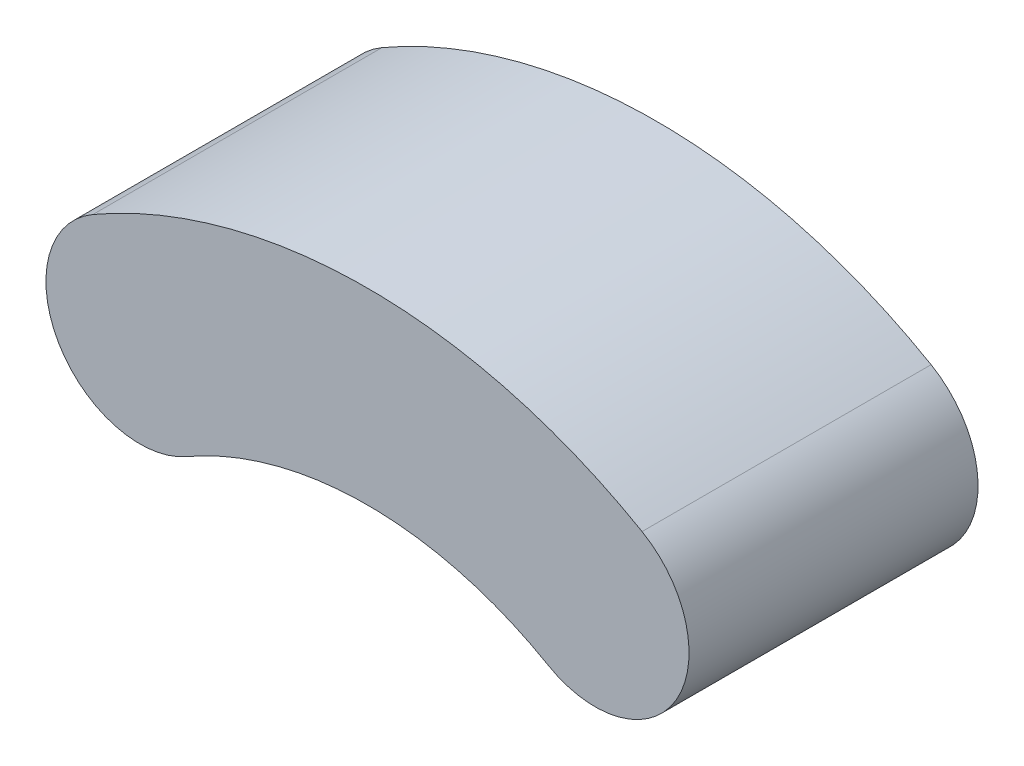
ISO-10303-21;
HEADER;
FILE_DESCRIPTION(('STEP AP214'),'2;1');
FILE_NAME('part.step','',(''),(''),'','','');
FILE_SCHEMA(('AUTOMOTIVE_DESIGN { 1 0 10303 214 1 1 1 1 }'));
ENDSEC;
DATA;
#1=APPLICATION_CONTEXT('core data for automotive mechanical design processes');
#2=APPLICATION_PROTOCOL_DEFINITION('international standard','automotive_design',2000,#1);
#3=PRODUCT_CONTEXT('',#1,'mechanical');
#4=PRODUCT('Part','Part','',(#3));
#5=PRODUCT_RELATED_PRODUCT_CATEGORY('part','',(#4));
#6=PRODUCT_DEFINITION_FORMATION('','',#4);
#7=PRODUCT_DEFINITION_CONTEXT('part definition',#1,'design');
#8=PRODUCT_DEFINITION('design','',#6,#7);
#9=PRODUCT_DEFINITION_SHAPE('','',#8);
#10=(LENGTH_UNIT() NAMED_UNIT(*) SI_UNIT(.MILLI.,.METRE.));
#11=(NAMED_UNIT(*) PLANE_ANGLE_UNIT() SI_UNIT($,.RADIAN.));
#12=(NAMED_UNIT(*) SI_UNIT($,.STERADIAN.) SOLID_ANGLE_UNIT());
#13=UNCERTAINTY_MEASURE_WITH_UNIT(LENGTH_MEASURE(1.E-05),#10,'distance_accuracy_value','');
#14=(GEOMETRIC_REPRESENTATION_CONTEXT(3) GLOBAL_UNCERTAINTY_ASSIGNED_CONTEXT((#13)) GLOBAL_UNIT_ASSIGNED_CONTEXT((#10,
#11,#12)) REPRESENTATION_CONTEXT('',''));
#15=CARTESIAN_POINT('',(0.,0.,0.));
#16=DIRECTION('',(0.,0.,1.));
#17=DIRECTION('',(1.,0.,0.));
#18=AXIS2_PLACEMENT_3D('',#15,#16,#17);
#19=CARTESIAN_POINT('',(21.650635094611,12.4999999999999,0.));
#20=DIRECTION('',(0.,0.,1.));
#21=DIRECTION('',(1.,0.,0.));
#22=AXIS2_PLACEMENT_3D('',#19,#20,#21);
#23=PLANE('',#22);
#24=CARTESIAN_POINT('',(0.,0.,0.));
#25=DIRECTION('',(0.,0.,1.));
#26=DIRECTION('',(1.,0.,0.));
#27=AXIS2_PLACEMENT_3D('',#24,#25,#26);
#28=CIRCLE('',#27,38.);
#29=CARTESIAN_POINT('',(19.,32.9089653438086,0.));
#30=VERTEX_POINT('',#29);
#31=CARTESIAN_POINT('',(-19.,32.9089653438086,0.));
#32=VERTEX_POINT('',#31);
#33=EDGE_CURVE('E59',#30,#32,#28,.T.);
#34=ORIENTED_EDGE('',*,*,#33,.F.);
#35=CARTESIAN_POINT('',(15.75,27.2798002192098,0.));
#36=DIRECTION('',(0.,0.,1.));
#37=DIRECTION('',(1.,0.,0.));
#38=AXIS2_PLACEMENT_3D('',#35,#36,#37);
#39=CIRCLE('',#38,6.5);
#40=CARTESIAN_POINT('',(12.5,21.650635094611,0.));
#41=VERTEX_POINT('',#40);
#42=EDGE_CURVE('E79',#41,#30,#39,.T.);
#43=ORIENTED_EDGE('',*,*,#42,.F.);
#44=CARTESIAN_POINT('',(0.,0.,0.));
#45=DIRECTION('',(0.,0.,-1.));
#46=DIRECTION('',(1.,0.,0.));
#47=AXIS2_PLACEMENT_3D('',#44,#45,#46);
#48=CIRCLE('',#47,25.);
#49=CARTESIAN_POINT('',(-12.5,21.650635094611,0.));
#50=VERTEX_POINT('',#49);
#51=EDGE_CURVE('E85',#50,#41,#48,.T.);
#52=ORIENTED_EDGE('',*,*,#51,.F.);
#53=CARTESIAN_POINT('',(-15.75,27.2798002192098,0.));
#54=DIRECTION('',(0.,0.,1.));
#55=DIRECTION('',(1.,0.,0.));
#56=AXIS2_PLACEMENT_3D('',#53,#54,#55);
#57=CIRCLE('',#56,6.5);
#58=EDGE_CURVE('E90',#32,#50,#57,.T.);
#59=ORIENTED_EDGE('',*,*,#58,.F.);
#60=EDGE_LOOP('',(#34,#43,#52,#59));
#61=FACE_BOUND('',#60,.T.);
#62=ADVANCED_FACE('F34',(#61),#23,.F.);
#63=CARTESIAN_POINT('',(0.,0.,0.));
#64=DIRECTION('',(0.,0.,1.));
#65=DIRECTION('',(1.,0.,0.));
#66=AXIS2_PLACEMENT_3D('',#63,#64,#65);
#67=CYLINDRICAL_SURFACE('',#66,38.);
#68=CARTESIAN_POINT('',(0.,0.,20.));
#69=DIRECTION('',(0.,0.,1.));
#70=DIRECTION('',(1.,0.,0.));
#71=AXIS2_PLACEMENT_3D('',#68,#69,#70);
#72=CIRCLE('',#71,38.);
#73=CARTESIAN_POINT('',(19.,32.9089653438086,20.));
#74=VERTEX_POINT('',#73);
#75=CARTESIAN_POINT('',(-19.,32.9089653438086,20.));
#76=VERTEX_POINT('',#75);
#77=EDGE_CURVE('E95',#74,#76,#72,.T.);
#78=ORIENTED_EDGE('',*,*,#77,.F.);
#79=DIRECTION('',(0.,0.,1.));
#80=VECTOR('',#79,1.);
#81=CARTESIAN_POINT('',(19.,32.9089653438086,0.));
#82=LINE('',#81,#80);
#83=EDGE_CURVE('E12',#30,#74,#82,.T.);
#84=ORIENTED_EDGE('',*,*,#83,.F.);
#85=ORIENTED_EDGE('',*,*,#33,.T.);
#86=DIRECTION('',(0.,0.,1.));
#87=VECTOR('',#86,1.);
#88=CARTESIAN_POINT('',(-19.,32.9089653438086,0.));
#89=LINE('',#88,#87);
#90=EDGE_CURVE('E38',#32,#76,#89,.T.);
#91=ORIENTED_EDGE('',*,*,#90,.T.);
#92=EDGE_LOOP('',(#78,#84,#85,#91));
#93=FACE_BOUND('',#92,.T.);
#94=ADVANCED_FACE('F107',(#93),#67,.T.);
#95=CARTESIAN_POINT('',(15.75,27.2798002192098,0.));
#96=DIRECTION('',(0.,0.,1.));
#97=DIRECTION('',(1.,0.,0.));
#98=AXIS2_PLACEMENT_3D('',#95,#96,#97);
#99=CYLINDRICAL_SURFACE('',#98,6.5);
#100=CARTESIAN_POINT('',(15.75,27.2798002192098,20.));
#101=DIRECTION('',(0.,0.,1.));
#102=DIRECTION('',(1.,0.,0.));
#103=AXIS2_PLACEMENT_3D('',#100,#101,#102);
#104=CIRCLE('',#103,6.5);
#105=CARTESIAN_POINT('',(12.5,21.650635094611,20.));
#106=VERTEX_POINT('',#105);
#107=EDGE_CURVE('E81',#106,#74,#104,.T.);
#108=ORIENTED_EDGE('',*,*,#107,.F.);
#109=DIRECTION('',(0.,0.,1.));
#110=VECTOR('',#109,1.);
#111=CARTESIAN_POINT('',(12.5,21.650635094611,0.));
#112=LINE('',#111,#110);
#113=EDGE_CURVE('E43',#41,#106,#112,.T.);
#114=ORIENTED_EDGE('',*,*,#113,.F.);
#115=ORIENTED_EDGE('',*,*,#42,.T.);
#116=ORIENTED_EDGE('',*,*,#83,.T.);
#117=EDGE_LOOP('',(#108,#114,#115,#116));
#118=FACE_BOUND('',#117,.T.);
#119=ADVANCED_FACE('F77',(#118),#99,.T.);
#120=CARTESIAN_POINT('',(0.,0.,0.));
#121=DIRECTION('',(0.,0.,1.));
#122=DIRECTION('',(1.,0.,0.));
#123=AXIS2_PLACEMENT_3D('',#120,#121,#122);
#124=CYLINDRICAL_SURFACE('',#123,25.);
#125=CARTESIAN_POINT('',(0.,0.,20.));
#126=DIRECTION('',(0.,0.,-1.));
#127=DIRECTION('',(1.,0.,0.));
#128=AXIS2_PLACEMENT_3D('',#125,#126,#127);
#129=CIRCLE('',#128,25.);
#130=CARTESIAN_POINT('',(-12.5,21.650635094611,20.));
#131=VERTEX_POINT('',#130);
#132=EDGE_CURVE('E51',#131,#106,#129,.T.);
#133=ORIENTED_EDGE('',*,*,#132,.F.);
#134=DIRECTION('',(0.,0.,1.));
#135=VECTOR('',#134,1.);
#136=CARTESIAN_POINT('',(-12.5,21.650635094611,0.));
#137=LINE('',#136,#135);
#138=EDGE_CURVE('E82',#50,#131,#137,.T.);
#139=ORIENTED_EDGE('',*,*,#138,.F.);
#140=ORIENTED_EDGE('',*,*,#51,.T.);
#141=ORIENTED_EDGE('',*,*,#113,.T.);
#142=EDGE_LOOP('',(#133,#139,#140,#141));
#143=FACE_BOUND('',#142,.T.);
#144=ADVANCED_FACE('F86',(#143),#124,.F.);
#145=CARTESIAN_POINT('',(-15.75,27.2798002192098,0.));
#146=DIRECTION('',(0.,0.,1.));
#147=DIRECTION('',(1.,0.,0.));
#148=AXIS2_PLACEMENT_3D('',#145,#146,#147);
#149=CYLINDRICAL_SURFACE('',#148,6.5);
#150=CARTESIAN_POINT('',(-15.75,27.2798002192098,20.));
#151=DIRECTION('',(0.,0.,1.));
#152=DIRECTION('',(1.,0.,0.));
#153=AXIS2_PLACEMENT_3D('',#150,#151,#152);
#154=CIRCLE('',#153,6.5);
#155=EDGE_CURVE('E98',#76,#131,#154,.T.);
#156=ORIENTED_EDGE('',*,*,#155,.F.);
#157=ORIENTED_EDGE('',*,*,#90,.F.);
#158=ORIENTED_EDGE('',*,*,#58,.T.);
#159=ORIENTED_EDGE('',*,*,#138,.T.);
#160=EDGE_LOOP('',(#156,#157,#158,#159));
#161=FACE_BOUND('',#160,.T.);
#162=ADVANCED_FACE('F104',(#161),#149,.T.);
#163=CARTESIAN_POINT('',(21.650635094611,12.4999999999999,20.));
#164=DIRECTION('',(0.,0.,1.));
#165=DIRECTION('',(1.,0.,0.));
#166=AXIS2_PLACEMENT_3D('',#163,#164,#165);
#167=PLANE('',#166);
#168=ORIENTED_EDGE('',*,*,#107,.T.);
#169=ORIENTED_EDGE('',*,*,#77,.T.);
#170=ORIENTED_EDGE('',*,*,#155,.T.);
#171=ORIENTED_EDGE('',*,*,#132,.T.);
#172=EDGE_LOOP('',(#168,#169,#170,#171));
#173=FACE_BOUND('',#172,.T.);
#174=ADVANCED_FACE('F36',(#173),#167,.T.);
#175=CLOSED_SHELL('',(#62,#94,#119,#144,#162,#174));
#176=MANIFOLD_SOLID_BREP('B2',#175);
#177=ADVANCED_BREP_SHAPE_REPRESENTATION('',(#18,#176),#14);
#178=SHAPE_DEFINITION_REPRESENTATION(#9,#177);
ENDSEC;
END-ISO-10303-21;
